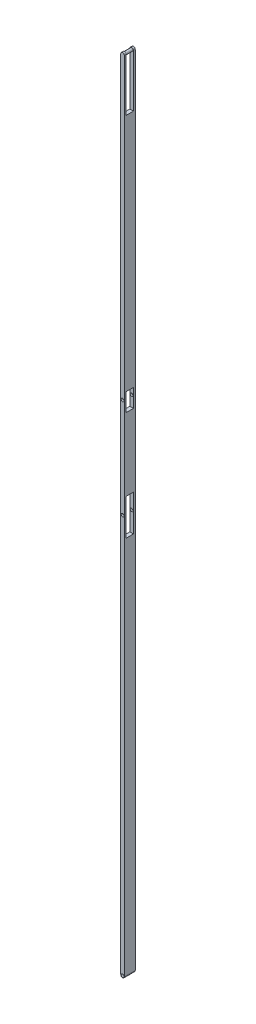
ISO-10303-21;
HEADER;
FILE_DESCRIPTION(('STEP AP214'),'2;1');
FILE_NAME('part.step','',(''),(''),'','','');
FILE_SCHEMA(('AUTOMOTIVE_DESIGN { 1 0 10303 214 1 1 1 1 }'));
ENDSEC;
DATA;
#1=APPLICATION_CONTEXT('core data for automotive mechanical design processes');
#2=APPLICATION_PROTOCOL_DEFINITION('international standard','automotive_design',2000,#1);
#3=PRODUCT_CONTEXT('',#1,'mechanical');
#4=PRODUCT('Part','Part','',(#3));
#5=PRODUCT_RELATED_PRODUCT_CATEGORY('part','',(#4));
#6=PRODUCT_DEFINITION_FORMATION('','',#4);
#7=PRODUCT_DEFINITION_CONTEXT('part definition',#1,'design');
#8=PRODUCT_DEFINITION('design','',#6,#7);
#9=PRODUCT_DEFINITION_SHAPE('','',#8);
#10=(LENGTH_UNIT() NAMED_UNIT(*) SI_UNIT(.MILLI.,.METRE.));
#11=(NAMED_UNIT(*) PLANE_ANGLE_UNIT() SI_UNIT($,.RADIAN.));
#12=(NAMED_UNIT(*) SI_UNIT($,.STERADIAN.) SOLID_ANGLE_UNIT());
#13=UNCERTAINTY_MEASURE_WITH_UNIT(LENGTH_MEASURE(1.E-05),#10,'distance_accuracy_value','');
#14=(GEOMETRIC_REPRESENTATION_CONTEXT(3) GLOBAL_UNCERTAINTY_ASSIGNED_CONTEXT((#13)) GLOBAL_UNIT_ASSIGNED_CONTEXT((#10,
#11,#12)) REPRESENTATION_CONTEXT('',''));
#15=CARTESIAN_POINT('',(0.,0.,0.));
#16=DIRECTION('',(0.,0.,1.));
#17=DIRECTION('',(1.,0.,0.));
#18=AXIS2_PLACEMENT_3D('',#15,#16,#17);
#19=CARTESIAN_POINT('',(-2.06104888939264E-13,2200.,30.));
#20=DIRECTION('',(0.,0.,-1.));
#21=DIRECTION('',(-1.,0.,0.));
#22=AXIS2_PLACEMENT_3D('',#19,#20,#21);
#23=CYLINDRICAL_SURFACE('',#22,5.00000000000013);
#24=DIRECTION('',(0.,0.,-1.));
#25=VECTOR('',#24,1.);
#26=CARTESIAN_POINT('',(4.99999999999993,2200.,30.));
#27=LINE('',#26,#25);
#28=CARTESIAN_POINT('',(4.99999999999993,2200.,30.));
#29=VERTEX_POINT('',#28);
#30=CARTESIAN_POINT('',(5.,2200.,25.));
#31=VERTEX_POINT('',#30);
#32=EDGE_CURVE('E299',#29,#31,#27,.T.);
#33=ORIENTED_EDGE('',*,*,#32,.T.);
#34=CARTESIAN_POINT('',(-2.06104888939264E-13,2200.,25.));
#35=DIRECTION('',(0.,0.,1.));
#36=DIRECTION('',(0.,-1.,0.));
#37=AXIS2_PLACEMENT_3D('',#34,#35,#36);
#38=CIRCLE('',#37,5.00000000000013);
#39=CARTESIAN_POINT('',(-5.00000000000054,2200.,25.));
#40=VERTEX_POINT('',#39);
#41=EDGE_CURVE('E185',#31,#40,#38,.T.);
#42=ORIENTED_EDGE('',*,*,#41,.T.);
#43=DIRECTION('',(0.,0.,-1.));
#44=VECTOR('',#43,1.);
#45=CARTESIAN_POINT('',(-5.00000000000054,2200.,30.));
#46=LINE('',#45,#44);
#47=CARTESIAN_POINT('',(-5.00000000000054,2200.,30.));
#48=VERTEX_POINT('',#47);
#49=EDGE_CURVE('E296',#48,#40,#46,.T.);
#50=ORIENTED_EDGE('',*,*,#49,.F.);
#51=CARTESIAN_POINT('',(-2.06104888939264E-13,2200.,30.));
#52=DIRECTION('',(0.,0.,1.));
#53=DIRECTION('',(1.,0.,0.));
#54=AXIS2_PLACEMENT_3D('',#51,#52,#53);
#55=CIRCLE('',#54,5.00000000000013);
#56=EDGE_CURVE('E280',#29,#48,#55,.T.);
#57=ORIENTED_EDGE('',*,*,#56,.F.);
#58=EDGE_LOOP('',(#33,#42,#50,#57));
#59=FACE_BOUND('',#58,.T.);
#60=ADVANCED_FACE('F41',(#59),#23,.T.);
#61=CARTESIAN_POINT('',(0.,1100.,30.));
#62=DIRECTION('',(0.,0.,-1.));
#63=DIRECTION('',(-1.,0.,0.));
#64=AXIS2_PLACEMENT_3D('',#61,#62,#63);
#65=CYLINDRICAL_SURFACE('',#64,4.);
#66=CARTESIAN_POINT('',(0.,1100.,25.));
#67=DIRECTION('',(0.,0.,1.));
#68=DIRECTION('',(0.,-1.,0.));
#69=AXIS2_PLACEMENT_3D('',#66,#67,#68);
#70=CIRCLE('',#69,4.);
#71=CARTESIAN_POINT('',(0.,1096.,25.));
#72=VERTEX_POINT('',#71);
#73=EDGE_CURVE('E231',#72,#72,#70,.F.);
#74=ORIENTED_EDGE('',*,*,#73,.T.);
#75=EDGE_LOOP('',(#74));
#76=FACE_BOUND('',#75,.T.);
#77=CARTESIAN_POINT('',(0.,1100.,30.));
#78=DIRECTION('',(0.,0.,-1.));
#79=DIRECTION('',(-1.,0.,0.));
#80=AXIS2_PLACEMENT_3D('',#77,#78,#79);
#81=CIRCLE('',#80,4.);
#82=CARTESIAN_POINT('',(-3.99999999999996,1100.,30.));
#83=VERTEX_POINT('',#82);
#84=EDGE_CURVE('E224',#83,#83,#81,.T.);
#85=ORIENTED_EDGE('',*,*,#84,.F.);
#86=EDGE_LOOP('',(#85));
#87=FACE_BOUND('',#86,.T.);
#88=ADVANCED_FACE('F311',(#76,#87),#65,.F.);
#89=CARTESIAN_POINT('',(0.,0.,30.));
#90=DIRECTION('',(0.,0.,-1.));
#91=DIRECTION('',(-1.,0.,0.));
#92=AXIS2_PLACEMENT_3D('',#89,#90,#91);
#93=CYLINDRICAL_SURFACE('',#92,5.);
#94=CARTESIAN_POINT('',(0.,0.,0.));
#95=DIRECTION('',(0.,0.,1.));
#96=DIRECTION('',(1.,0.,0.));
#97=AXIS2_PLACEMENT_3D('',#94,#95,#96);
#98=CIRCLE('',#97,5.);
#99=CARTESIAN_POINT('',(-5.,0.,0.));
#100=VERTEX_POINT('',#99);
#101=CARTESIAN_POINT('',(5.,0.,0.));
#102=VERTEX_POINT('',#101);
#103=EDGE_CURVE('E267',#100,#102,#98,.T.);
#104=ORIENTED_EDGE('',*,*,#103,.T.);
#105=DIRECTION('',(0.,0.,-1.));
#106=VECTOR('',#105,1.);
#107=CARTESIAN_POINT('',(5.,0.,30.));
#108=LINE('',#107,#106);
#109=CARTESIAN_POINT('',(5.,0.,30.));
#110=VERTEX_POINT('',#109);
#111=EDGE_CURVE('E50',#110,#102,#108,.T.);
#112=ORIENTED_EDGE('',*,*,#111,.F.);
#113=CARTESIAN_POINT('',(0.,0.,30.));
#114=DIRECTION('',(0.,0.,1.));
#115=DIRECTION('',(1.,0.,0.));
#116=AXIS2_PLACEMENT_3D('',#113,#114,#115);
#117=CIRCLE('',#116,5.);
#118=CARTESIAN_POINT('',(-5.,0.,30.));
#119=VERTEX_POINT('',#118);
#120=EDGE_CURVE('E274',#119,#110,#117,.T.);
#121=ORIENTED_EDGE('',*,*,#120,.F.);
#122=DIRECTION('',(0.,0.,-1.));
#123=VECTOR('',#122,1.);
#124=CARTESIAN_POINT('',(-5.,0.,30.));
#125=LINE('',#124,#123);
#126=EDGE_CURVE('E284',#119,#100,#125,.T.);
#127=ORIENTED_EDGE('',*,*,#126,.T.);
#128=EDGE_LOOP('',(#104,#112,#121,#127));
#129=FACE_BOUND('',#128,.T.);
#130=ADVANCED_FACE('F43',(#129),#93,.T.);
#131=CARTESIAN_POINT('',(4.99999999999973,2200.,30.));
#132=DIRECTION('',(-1.,0.,0.));
#133=DIRECTION('',(0.,-1.,0.));
#134=AXIS2_PLACEMENT_3D('',#131,#132,#133);
#135=PLANE('',#134);
#136=DIRECTION('',(0.,0.,-1.));
#137=VECTOR('',#136,1.);
#138=CARTESIAN_POINT('',(4.99999999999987,1045.,25.));
#139=LINE('',#138,#137);
#140=CARTESIAN_POINT('',(4.99999999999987,1045.,25.));
#141=VERTEX_POINT('',#140);
#142=CARTESIAN_POINT('',(4.99999999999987,1045.,4.99999999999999));
#143=VERTEX_POINT('',#142);
#144=EDGE_CURVE('E208',#141,#143,#139,.T.);
#145=ORIENTED_EDGE('',*,*,#144,.F.);
#146=DIRECTION('',(0.,-1.,0.));
#147=VECTOR('',#146,1.);
#148=CARTESIAN_POINT('',(4.99999999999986,1145.,25.));
#149=LINE('',#148,#147);
#150=CARTESIAN_POINT('',(4.99999999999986,1145.,25.));
#151=VERTEX_POINT('',#150);
#152=EDGE_CURVE('E64',#151,#141,#149,.T.);
#153=ORIENTED_EDGE('',*,*,#152,.F.);
#154=DIRECTION('',(0.,0.,1.));
#155=VECTOR('',#154,1.);
#156=CARTESIAN_POINT('',(4.99999999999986,1145.,25.));
#157=LINE('',#156,#155);
#158=CARTESIAN_POINT('',(4.99999999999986,1145.,5.));
#159=VERTEX_POINT('',#158);
#160=EDGE_CURVE('E197',#159,#151,#157,.T.);
#161=ORIENTED_EDGE('',*,*,#160,.F.);
#162=DIRECTION('',(0.,1.,0.));
#163=VECTOR('',#162,1.);
#164=CARTESIAN_POINT('',(4.99999999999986,1145.,5.));
#165=LINE('',#164,#163);
#166=EDGE_CURVE('E211',#143,#159,#165,.T.);
#167=ORIENTED_EDGE('',*,*,#166,.F.);
#168=EDGE_LOOP('',(#145,#153,#161,#167));
#169=FACE_BOUND('',#168,.T.);
#170=DIRECTION('',(0.,0.,-1.));
#171=VECTOR('',#170,1.);
#172=CARTESIAN_POINT('',(4.99999999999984,1345.,25.));
#173=LINE('',#172,#171);
#174=CARTESIAN_POINT('',(4.99999999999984,1345.,25.));
#175=VERTEX_POINT('',#174);
#176=CARTESIAN_POINT('',(4.99999999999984,1345.,4.99999999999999));
#177=VERTEX_POINT('',#176);
#178=EDGE_CURVE('E257',#175,#177,#173,.T.);
#179=ORIENTED_EDGE('',*,*,#178,.F.);
#180=DIRECTION('',(0.,-1.,0.));
#181=VECTOR('',#180,1.);
#182=CARTESIAN_POINT('',(4.99999999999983,1395.,25.));
#183=LINE('',#182,#181);
#184=CARTESIAN_POINT('',(4.99999999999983,1395.,25.));
#185=VERTEX_POINT('',#184);
#186=EDGE_CURVE('E241',#185,#175,#183,.T.);
#187=ORIENTED_EDGE('',*,*,#186,.F.);
#188=DIRECTION('',(0.,0.,1.));
#189=VECTOR('',#188,1.);
#190=CARTESIAN_POINT('',(4.99999999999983,1395.,25.));
#191=LINE('',#190,#189);
#192=CARTESIAN_POINT('',(4.99999999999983,1395.,5.));
#193=VERTEX_POINT('',#192);
#194=EDGE_CURVE('E246',#193,#185,#191,.T.);
#195=ORIENTED_EDGE('',*,*,#194,.F.);
#196=DIRECTION('',(0.,1.,0.));
#197=VECTOR('',#196,1.);
#198=CARTESIAN_POINT('',(4.99999999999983,1395.,5.));
#199=LINE('',#198,#197);
#200=EDGE_CURVE('E260',#177,#193,#199,.T.);
#201=ORIENTED_EDGE('',*,*,#200,.F.);
#202=EDGE_LOOP('',(#179,#187,#195,#201));
#203=FACE_BOUND('',#202,.T.);
#204=DIRECTION('',(0.,0.,1.));
#205=VECTOR('',#204,1.);
#206=CARTESIAN_POINT('',(5.00000000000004,2055.,25.));
#207=LINE('',#206,#205);
#208=CARTESIAN_POINT('',(5.00000000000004,2055.,5.00000000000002));
#209=VERTEX_POINT('',#208);
#210=CARTESIAN_POINT('',(5.00000000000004,2055.,25.));
#211=VERTEX_POINT('',#210);
#212=EDGE_CURVE('E162',#209,#211,#207,.T.);
#213=ORIENTED_EDGE('',*,*,#212,.T.);
#214=DIRECTION('',(0.,1.,0.));
#215=VECTOR('',#214,1.);
#216=CARTESIAN_POINT('',(5.,2205.,25.));
#217=LINE('',#216,#215);
#218=EDGE_CURVE('E173',#211,#31,#217,.T.);
#219=ORIENTED_EDGE('',*,*,#218,.T.);
#220=ORIENTED_EDGE('',*,*,#32,.F.);
#221=DIRECTION('',(0.,1.,0.));
#222=VECTOR('',#221,1.);
#223=CARTESIAN_POINT('',(4.99999999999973,2200.,30.));
#224=LINE('',#223,#222);
#225=EDGE_CURVE('E277',#110,#29,#224,.T.);
#226=ORIENTED_EDGE('',*,*,#225,.F.);
#227=ORIENTED_EDGE('',*,*,#111,.T.);
#228=DIRECTION('',(0.,1.,0.));
#229=VECTOR('',#228,1.);
#230=CARTESIAN_POINT('',(4.99999999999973,2200.,0.));
#231=LINE('',#230,#229);
#232=CARTESIAN_POINT('',(4.99999999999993,2200.,0.));
#233=VERTEX_POINT('',#232);
#234=EDGE_CURVE('E287',#102,#233,#231,.T.);
#235=ORIENTED_EDGE('',*,*,#234,.T.);
#236=CARTESIAN_POINT('',(5.,2200.,5.));
#237=VERTEX_POINT('',#236);
#238=EDGE_CURVE('E172',#237,#233,#27,.T.);
#239=ORIENTED_EDGE('',*,*,#238,.F.);
#240=DIRECTION('',(0.,-1.,0.));
#241=VECTOR('',#240,1.);
#242=CARTESIAN_POINT('',(5.,2205.,5.));
#243=LINE('',#242,#241);
#244=EDGE_CURVE('E156',#237,#209,#243,.T.);
#245=ORIENTED_EDGE('',*,*,#244,.T.);
#246=EDGE_LOOP('',(#213,#219,#220,#226,#227,#235,#239,#245));
#247=FACE_BOUND('',#246,.T.);
#248=ADVANCED_FACE('F170',(#169,#203,#247),#135,.F.);
#249=CARTESIAN_POINT('',(-2.06104888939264E-13,2200.,5.));
#250=DIRECTION('',(0.,0.,-1.));
#251=DIRECTION('',(0.,1.,0.));
#252=AXIS2_PLACEMENT_3D('',#249,#250,#251);
#253=CIRCLE('',#252,5.00000000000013);
#254=CARTESIAN_POINT('',(-5.00000000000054,2200.,5.00000000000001));
#255=VERTEX_POINT('',#254);
#256=EDGE_CURVE('E57',#255,#237,#253,.T.);
#257=ORIENTED_EDGE('',*,*,#256,.T.);
#258=ORIENTED_EDGE('',*,*,#238,.T.);
#259=CARTESIAN_POINT('',(-2.06104888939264E-13,2200.,0.));
#260=DIRECTION('',(0.,0.,1.));
#261=DIRECTION('',(1.,0.,0.));
#262=AXIS2_PLACEMENT_3D('',#259,#260,#261);
#263=CIRCLE('',#262,5.00000000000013);
#264=CARTESIAN_POINT('',(-5.00000000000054,2200.,0.));
#265=VERTEX_POINT('',#264);
#266=EDGE_CURVE('E289',#233,#265,#263,.T.);
#267=ORIENTED_EDGE('',*,*,#266,.T.);
#268=EDGE_CURVE('E295',#255,#265,#46,.T.);
#269=ORIENTED_EDGE('',*,*,#268,.F.);
#270=EDGE_LOOP('',(#257,#258,#267,#269));
#271=FACE_BOUND('',#270,.T.);
#272=ADVANCED_FACE('F333',(#271),#23,.T.);
#273=CARTESIAN_POINT('',(-5.,0.,30.));
#274=DIRECTION('',(1.,0.,0.));
#275=DIRECTION('',(0.,1.,0.));
#276=AXIS2_PLACEMENT_3D('',#273,#274,#275);
#277=PLANE('',#276);
#278=DIRECTION('',(0.,0.,1.));
#279=VECTOR('',#278,1.);
#280=CARTESIAN_POINT('',(-5.00000000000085,1145.,25.));
#281=LINE('',#280,#279);
#282=CARTESIAN_POINT('',(-5.00000000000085,1145.,5.));
#283=VERTEX_POINT('',#282);
#284=CARTESIAN_POINT('',(-5.00000000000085,1145.,25.));
#285=VERTEX_POINT('',#284);
#286=EDGE_CURVE('E203',#283,#285,#281,.T.);
#287=ORIENTED_EDGE('',*,*,#286,.T.);
#288=DIRECTION('',(0.,-1.,0.));
#289=VECTOR('',#288,1.);
#290=CARTESIAN_POINT('',(-5.00000000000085,1145.,25.));
#291=LINE('',#290,#289);
#292=CARTESIAN_POINT('',(-5.00000000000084,1045.,25.));
#293=VERTEX_POINT('',#292);
#294=EDGE_CURVE('E193',#285,#293,#291,.T.);
#295=ORIENTED_EDGE('',*,*,#294,.T.);
#296=DIRECTION('',(0.,0.,-1.));
#297=VECTOR('',#296,1.);
#298=CARTESIAN_POINT('',(-5.00000000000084,1045.,25.));
#299=LINE('',#298,#297);
#300=CARTESIAN_POINT('',(-5.00000000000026,1045.,4.99999999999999));
#301=VERTEX_POINT('',#300);
#302=EDGE_CURVE('E196',#293,#301,#299,.T.);
#303=ORIENTED_EDGE('',*,*,#302,.T.);
#304=DIRECTION('',(0.,1.,0.));
#305=VECTOR('',#304,1.);
#306=CARTESIAN_POINT('',(-5.00000000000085,1145.,5.));
#307=LINE('',#306,#305);
#308=EDGE_CURVE('E200',#301,#283,#307,.T.);
#309=ORIENTED_EDGE('',*,*,#308,.T.);
#310=EDGE_LOOP('',(#287,#295,#303,#309));
#311=FACE_BOUND('',#310,.T.);
#312=DIRECTION('',(0.,0.,1.));
#313=VECTOR('',#312,1.);
#314=CARTESIAN_POINT('',(-5.00000000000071,1395.,25.));
#315=LINE('',#314,#313);
#316=CARTESIAN_POINT('',(-5.00000000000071,1395.,5.));
#317=VERTEX_POINT('',#316);
#318=CARTESIAN_POINT('',(-5.00000000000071,1395.,25.));
#319=VERTEX_POINT('',#318);
#320=EDGE_CURVE('E252',#317,#319,#315,.T.);
#321=ORIENTED_EDGE('',*,*,#320,.T.);
#322=DIRECTION('',(0.,-1.,0.));
#323=VECTOR('',#322,1.);
#324=CARTESIAN_POINT('',(-5.00000000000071,1395.,25.));
#325=LINE('',#324,#323);
#326=CARTESIAN_POINT('',(-5.0000000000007,1345.,25.));
#327=VERTEX_POINT('',#326);
#328=EDGE_CURVE('E242',#319,#327,#325,.T.);
#329=ORIENTED_EDGE('',*,*,#328,.T.);
#330=DIRECTION('',(0.,0.,-1.));
#331=VECTOR('',#330,1.);
#332=CARTESIAN_POINT('',(-5.0000000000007,1345.,25.));
#333=LINE('',#332,#331);
#334=CARTESIAN_POINT('',(-5.00000000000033,1345.,4.99999999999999));
#335=VERTEX_POINT('',#334);
#336=EDGE_CURVE('E245',#327,#335,#333,.T.);
#337=ORIENTED_EDGE('',*,*,#336,.T.);
#338=DIRECTION('',(0.,1.,0.));
#339=VECTOR('',#338,1.);
#340=CARTESIAN_POINT('',(-5.00000000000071,1395.,5.));
#341=LINE('',#340,#339);
#342=EDGE_CURVE('E249',#335,#317,#341,.T.);
#343=ORIENTED_EDGE('',*,*,#342,.T.);
#344=EDGE_LOOP('',(#321,#329,#337,#343));
#345=FACE_BOUND('',#344,.T.);
#346=ORIENTED_EDGE('',*,*,#49,.T.);
#347=DIRECTION('',(0.,1.,0.));
#348=VECTOR('',#347,1.);
#349=CARTESIAN_POINT('',(-5.00000000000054,2205.,25.));
#350=LINE('',#349,#348);
#351=CARTESIAN_POINT('',(-5.0000000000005,2055.,25.));
#352=VERTEX_POINT('',#351);
#353=EDGE_CURVE('E179',#352,#40,#350,.T.);
#354=ORIENTED_EDGE('',*,*,#353,.F.);
#355=DIRECTION('',(0.,0.,1.));
#356=VECTOR('',#355,1.);
#357=CARTESIAN_POINT('',(-5.0000000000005,2055.,25.));
#358=LINE('',#357,#356);
#359=CARTESIAN_POINT('',(-5.0000000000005,2055.,5.00000000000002));
#360=VERTEX_POINT('',#359);
#361=EDGE_CURVE('E175',#360,#352,#358,.T.);
#362=ORIENTED_EDGE('',*,*,#361,.F.);
#363=DIRECTION('',(0.,1.,0.));
#364=VECTOR('',#363,1.);
#365=CARTESIAN_POINT('',(-5.,0.,5.00000000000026));
#366=LINE('',#365,#364);
#367=EDGE_CURVE('E11',#360,#255,#366,.T.);
#368=ORIENTED_EDGE('',*,*,#367,.T.);
#369=ORIENTED_EDGE('',*,*,#268,.T.);
#370=DIRECTION('',(0.,-1.,0.));
#371=VECTOR('',#370,1.);
#372=CARTESIAN_POINT('',(-5.,0.,0.));
#373=LINE('',#372,#371);
#374=EDGE_CURVE('E278',#265,#100,#373,.T.);
#375=ORIENTED_EDGE('',*,*,#374,.T.);
#376=ORIENTED_EDGE('',*,*,#126,.F.);
#377=DIRECTION('',(0.,-1.,0.));
#378=VECTOR('',#377,1.);
#379=CARTESIAN_POINT('',(-5.,0.,30.));
#380=LINE('',#379,#378);
#381=EDGE_CURVE('E282',#48,#119,#380,.T.);
#382=ORIENTED_EDGE('',*,*,#381,.F.);
#383=EDGE_LOOP('',(#346,#354,#362,#368,#369,#375,#376,#382));
#384=FACE_BOUND('',#383,.T.);
#385=ADVANCED_FACE('F341',(#311,#345,#384),#277,.F.);
#386=CARTESIAN_POINT('',(0.,0.,30.));
#387=DIRECTION('',(0.,0.,1.));
#388=DIRECTION('',(1.,0.,0.));
#389=AXIS2_PLACEMENT_3D('',#386,#387,#388);
#390=PLANE('',#389);
#391=CARTESIAN_POINT('',(0.,0.,30.));
#392=DIRECTION('',(0.,0.,1.));
#393=DIRECTION('',(1.,0.,0.));
#394=AXIS2_PLACEMENT_3D('',#391,#392,#393);
#395=CIRCLE('',#394,4.);
#396=CARTESIAN_POINT('',(4.,0.,30.));
#397=VERTEX_POINT('',#396);
#398=EDGE_CURVE('E187',#397,#397,#395,.T.);
#399=ORIENTED_EDGE('',*,*,#398,.F.);
#400=EDGE_LOOP('',(#399));
#401=FACE_BOUND('',#400,.T.);
#402=ORIENTED_EDGE('',*,*,#84,.T.);
#403=EDGE_LOOP('',(#402));
#404=FACE_BOUND('',#403,.T.);
#405=CARTESIAN_POINT('',(0.,1375.,30.));
#406=DIRECTION('',(0.,0.,-1.));
#407=DIRECTION('',(-1.,0.,0.));
#408=AXIS2_PLACEMENT_3D('',#405,#406,#407);
#409=CIRCLE('',#408,4.);
#410=CARTESIAN_POINT('',(-4.,1375.,30.));
#411=VERTEX_POINT('',#410);
#412=EDGE_CURVE('E232',#411,#411,#409,.T.);
#413=ORIENTED_EDGE('',*,*,#412,.T.);
#414=EDGE_LOOP('',(#413));
#415=FACE_BOUND('',#414,.T.);
#416=ORIENTED_EDGE('',*,*,#120,.T.);
#417=ORIENTED_EDGE('',*,*,#225,.T.);
#418=ORIENTED_EDGE('',*,*,#56,.T.);
#419=ORIENTED_EDGE('',*,*,#381,.T.);
#420=EDGE_LOOP('',(#416,#417,#418,#419));
#421=FACE_BOUND('',#420,.T.);
#422=ADVANCED_FACE('F346',(#401,#404,#415,#421),#390,.T.);
#423=CARTESIAN_POINT('',(0.,0.,0.));
#424=DIRECTION('',(0.,0.,1.));
#425=DIRECTION('',(1.,0.,0.));
#426=AXIS2_PLACEMENT_3D('',#423,#424,#425);
#427=PLANE('',#426);
#428=CARTESIAN_POINT('',(0.,0.,0.));
#429=DIRECTION('',(0.,0.,1.));
#430=DIRECTION('',(1.,0.,0.));
#431=AXIS2_PLACEMENT_3D('',#428,#429,#430);
#432=CIRCLE('',#431,4.);
#433=CARTESIAN_POINT('',(4.,0.,0.));
#434=VERTEX_POINT('',#433);
#435=EDGE_CURVE('E188',#434,#434,#432,.T.);
#436=ORIENTED_EDGE('',*,*,#435,.T.);
#437=EDGE_LOOP('',(#436));
#438=FACE_BOUND('',#437,.T.);
#439=CARTESIAN_POINT('',(0.,1100.,0.));
#440=DIRECTION('',(0.,0.,-1.));
#441=DIRECTION('',(-1.,0.,0.));
#442=AXIS2_PLACEMENT_3D('',#439,#440,#441);
#443=CIRCLE('',#442,4.);
#444=CARTESIAN_POINT('',(-3.99999999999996,1100.,0.));
#445=VERTEX_POINT('',#444);
#446=EDGE_CURVE('E228',#445,#445,#443,.T.);
#447=ORIENTED_EDGE('',*,*,#446,.F.);
#448=EDGE_LOOP('',(#447));
#449=FACE_BOUND('',#448,.T.);
#450=CARTESIAN_POINT('',(0.,1375.,0.));
#451=DIRECTION('',(0.,0.,-1.));
#452=DIRECTION('',(-1.,0.,0.));
#453=AXIS2_PLACEMENT_3D('',#450,#451,#452);
#454=CIRCLE('',#453,4.);
#455=CARTESIAN_POINT('',(-4.,1375.,0.));
#456=VERTEX_POINT('',#455);
#457=EDGE_CURVE('E227',#456,#456,#454,.T.);
#458=ORIENTED_EDGE('',*,*,#457,.F.);
#459=EDGE_LOOP('',(#458));
#460=FACE_BOUND('',#459,.T.);
#461=ORIENTED_EDGE('',*,*,#103,.F.);
#462=ORIENTED_EDGE('',*,*,#374,.F.);
#463=ORIENTED_EDGE('',*,*,#266,.F.);
#464=ORIENTED_EDGE('',*,*,#234,.F.);
#465=EDGE_LOOP('',(#461,#462,#463,#464));
#466=FACE_BOUND('',#465,.T.);
#467=ADVANCED_FACE('F367',(#438,#449,#460,#466),#427,.F.);
#468=CARTESIAN_POINT('',(-5.00000000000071,1395.,25.));
#469=DIRECTION('',(0.,0.,1.));
#470=DIRECTION('',(0.,-1.,0.));
#471=AXIS2_PLACEMENT_3D('',#468,#469,#470);
#472=PLANE('',#471);
#473=CARTESIAN_POINT('',(0.,1375.,25.));
#474=DIRECTION('',(0.,0.,1.));
#475=DIRECTION('',(0.,-1.,0.));
#476=AXIS2_PLACEMENT_3D('',#473,#474,#475);
#477=CIRCLE('',#476,4.);
#478=CARTESIAN_POINT('',(0.,1371.,25.));
#479=VERTEX_POINT('',#478);
#480=EDGE_CURVE('E238',#479,#479,#477,.T.);
#481=ORIENTED_EDGE('',*,*,#480,.T.);
#482=EDGE_LOOP('',(#481));
#483=FACE_BOUND('',#482,.T.);
#484=ORIENTED_EDGE('',*,*,#186,.T.);
#485=DIRECTION('',(1.,0.,0.));
#486=VECTOR('',#485,1.);
#487=CARTESIAN_POINT('',(-5.0000000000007,1345.,25.));
#488=LINE('',#487,#486);
#489=EDGE_CURVE('E255',#327,#175,#488,.T.);
#490=ORIENTED_EDGE('',*,*,#489,.F.);
#491=ORIENTED_EDGE('',*,*,#328,.F.);
#492=DIRECTION('',(1.,0.,0.));
#493=VECTOR('',#492,1.);
#494=CARTESIAN_POINT('',(-5.00000000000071,1395.,25.));
#495=LINE('',#494,#493);
#496=EDGE_CURVE('E265',#319,#185,#495,.T.);
#497=ORIENTED_EDGE('',*,*,#496,.T.);
#498=EDGE_LOOP('',(#484,#490,#491,#497));
#499=FACE_BOUND('',#498,.T.);
#500=ADVANCED_FACE('F369',(#483,#499),#472,.F.);
#501=CARTESIAN_POINT('',(-5.00000000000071,1395.,25.));
#502=DIRECTION('',(0.,1.,0.));
#503=DIRECTION('',(-1.,0.,0.));
#504=AXIS2_PLACEMENT_3D('',#501,#502,#503);
#505=PLANE('',#504);
#506=ORIENTED_EDGE('',*,*,#194,.T.);
#507=ORIENTED_EDGE('',*,*,#496,.F.);
#508=ORIENTED_EDGE('',*,*,#320,.F.);
#509=DIRECTION('',(1.,0.,0.));
#510=VECTOR('',#509,1.);
#511=CARTESIAN_POINT('',(-5.00000000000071,1395.,5.));
#512=LINE('',#511,#510);
#513=EDGE_CURVE('E268',#317,#193,#512,.T.);
#514=ORIENTED_EDGE('',*,*,#513,.T.);
#515=EDGE_LOOP('',(#506,#507,#508,#514));
#516=FACE_BOUND('',#515,.T.);
#517=ADVANCED_FACE('F377',(#516),#505,.F.);
#518=CARTESIAN_POINT('',(-5.00000000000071,1395.,5.));
#519=DIRECTION('',(0.,0.,-1.));
#520=DIRECTION('',(0.,1.,0.));
#521=AXIS2_PLACEMENT_3D('',#518,#519,#520);
#522=PLANE('',#521);
#523=CARTESIAN_POINT('',(0.,1375.,4.99999999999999));
#524=DIRECTION('',(0.,0.,-1.));
#525=DIRECTION('',(0.,1.,0.));
#526=AXIS2_PLACEMENT_3D('',#523,#524,#525);
#527=CIRCLE('',#526,4.);
#528=CARTESIAN_POINT('',(0.,1379.,4.99999999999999));
#529=VERTEX_POINT('',#528);
#530=EDGE_CURVE('E235',#529,#529,#527,.T.);
#531=ORIENTED_EDGE('',*,*,#530,.T.);
#532=EDGE_LOOP('',(#531));
#533=FACE_BOUND('',#532,.T.);
#534=ORIENTED_EDGE('',*,*,#200,.T.);
#535=ORIENTED_EDGE('',*,*,#513,.F.);
#536=ORIENTED_EDGE('',*,*,#342,.F.);
#537=DIRECTION('',(1.,0.,0.));
#538=VECTOR('',#537,1.);
#539=CARTESIAN_POINT('',(-5.0000000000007,1345.,4.99999999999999));
#540=LINE('',#539,#538);
#541=EDGE_CURVE('E270',#335,#177,#540,.T.);
#542=ORIENTED_EDGE('',*,*,#541,.T.);
#543=EDGE_LOOP('',(#534,#535,#536,#542));
#544=FACE_BOUND('',#543,.T.);
#545=ADVANCED_FACE('F389',(#533,#544),#522,.F.);
#546=CARTESIAN_POINT('',(-5.0000000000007,1345.,25.));
#547=DIRECTION('',(0.,-1.,0.));
#548=DIRECTION('',(1.,0.,0.));
#549=AXIS2_PLACEMENT_3D('',#546,#547,#548);
#550=PLANE('',#549);
#551=ORIENTED_EDGE('',*,*,#178,.T.);
#552=ORIENTED_EDGE('',*,*,#541,.F.);
#553=ORIENTED_EDGE('',*,*,#336,.F.);
#554=ORIENTED_EDGE('',*,*,#489,.T.);
#555=EDGE_LOOP('',(#551,#552,#553,#554));
#556=FACE_BOUND('',#555,.T.);
#557=ADVANCED_FACE('F385',(#556),#550,.F.);
#558=CARTESIAN_POINT('',(0.,1375.,30.));
#559=DIRECTION('',(0.,0.,-1.));
#560=DIRECTION('',(-1.,0.,0.));
#561=AXIS2_PLACEMENT_3D('',#558,#559,#560);
#562=CYLINDRICAL_SURFACE('',#561,4.);
#563=ORIENTED_EDGE('',*,*,#457,.T.);
#564=EDGE_LOOP('',(#563));
#565=FACE_BOUND('',#564,.T.);
#566=ORIENTED_EDGE('',*,*,#530,.F.);
#567=EDGE_LOOP('',(#566));
#568=FACE_BOUND('',#567,.T.);
#569=ADVANCED_FACE('F388',(#565,#568),#562,.F.);
#570=ORIENTED_EDGE('',*,*,#412,.F.);
#571=EDGE_LOOP('',(#570));
#572=FACE_BOUND('',#571,.T.);
#573=ORIENTED_EDGE('',*,*,#480,.F.);
#574=EDGE_LOOP('',(#573));
#575=FACE_BOUND('',#574,.T.);
#576=ADVANCED_FACE('F326',(#572,#575),#562,.F.);
#577=CARTESIAN_POINT('',(0.,1100.,4.99999999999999));
#578=DIRECTION('',(0.,0.,-1.));
#579=DIRECTION('',(0.,1.,0.));
#580=AXIS2_PLACEMENT_3D('',#577,#578,#579);
#581=CIRCLE('',#580,4.);
#582=CARTESIAN_POINT('',(0.,1104.,4.99999999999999));
#583=VERTEX_POINT('',#582);
#584=EDGE_CURVE('E218',#583,#583,#581,.F.);
#585=ORIENTED_EDGE('',*,*,#584,.T.);
#586=EDGE_LOOP('',(#585));
#587=FACE_BOUND('',#586,.T.);
#588=ORIENTED_EDGE('',*,*,#446,.T.);
#589=EDGE_LOOP('',(#588));
#590=FACE_BOUND('',#589,.T.);
#591=ADVANCED_FACE('F317',(#587,#590),#65,.F.);
#592=CARTESIAN_POINT('',(-5.00000000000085,1145.,25.));
#593=DIRECTION('',(0.,0.,1.));
#594=DIRECTION('',(0.,-1.,0.));
#595=AXIS2_PLACEMENT_3D('',#592,#593,#594);
#596=PLANE('',#595);
#597=ORIENTED_EDGE('',*,*,#152,.T.);
#598=DIRECTION('',(1.,0.,0.));
#599=VECTOR('',#598,1.);
#600=CARTESIAN_POINT('',(-5.00000000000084,1045.,25.));
#601=LINE('',#600,#599);
#602=EDGE_CURVE('E206',#293,#141,#601,.T.);
#603=ORIENTED_EDGE('',*,*,#602,.F.);
#604=ORIENTED_EDGE('',*,*,#294,.F.);
#605=DIRECTION('',(1.,0.,0.));
#606=VECTOR('',#605,1.);
#607=CARTESIAN_POINT('',(-5.00000000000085,1145.,25.));
#608=LINE('',#607,#606);
#609=EDGE_CURVE('E216',#285,#151,#608,.T.);
#610=ORIENTED_EDGE('',*,*,#609,.T.);
#611=EDGE_LOOP('',(#597,#603,#604,#610));
#612=FACE_BOUND('',#611,.T.);
#613=ORIENTED_EDGE('',*,*,#73,.F.);
#614=EDGE_LOOP('',(#613));
#615=FACE_BOUND('',#614,.T.);
#616=ADVANCED_FACE('F314',(#612,#615),#596,.F.);
#617=CARTESIAN_POINT('',(-5.00000000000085,1145.,5.));
#618=DIRECTION('',(0.,0.,-1.));
#619=DIRECTION('',(0.,1.,0.));
#620=AXIS2_PLACEMENT_3D('',#617,#618,#619);
#621=PLANE('',#620);
#622=ORIENTED_EDGE('',*,*,#166,.T.);
#623=DIRECTION('',(1.,0.,0.));
#624=VECTOR('',#623,1.);
#625=CARTESIAN_POINT('',(-5.00000000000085,1145.,5.));
#626=LINE('',#625,#624);
#627=EDGE_CURVE('E219',#283,#159,#626,.T.);
#628=ORIENTED_EDGE('',*,*,#627,.F.);
#629=ORIENTED_EDGE('',*,*,#308,.F.);
#630=DIRECTION('',(1.,0.,0.));
#631=VECTOR('',#630,1.);
#632=CARTESIAN_POINT('',(-5.00000000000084,1045.,4.99999999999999));
#633=LINE('',#632,#631);
#634=EDGE_CURVE('E221',#301,#143,#633,.T.);
#635=ORIENTED_EDGE('',*,*,#634,.T.);
#636=EDGE_LOOP('',(#622,#628,#629,#635));
#637=FACE_BOUND('',#636,.T.);
#638=ORIENTED_EDGE('',*,*,#584,.F.);
#639=EDGE_LOOP('',(#638));
#640=FACE_BOUND('',#639,.T.);
#641=ADVANCED_FACE('F316',(#637,#640),#621,.F.);
#642=CARTESIAN_POINT('',(-5.00000000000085,1145.,25.));
#643=DIRECTION('',(0.,1.,0.));
#644=DIRECTION('',(-1.,0.,0.));
#645=AXIS2_PLACEMENT_3D('',#642,#643,#644);
#646=PLANE('',#645);
#647=ORIENTED_EDGE('',*,*,#160,.T.);
#648=ORIENTED_EDGE('',*,*,#609,.F.);
#649=ORIENTED_EDGE('',*,*,#286,.F.);
#650=ORIENTED_EDGE('',*,*,#627,.T.);
#651=EDGE_LOOP('',(#647,#648,#649,#650));
#652=FACE_BOUND('',#651,.T.);
#653=ADVANCED_FACE('F323',(#652),#646,.F.);
#654=CARTESIAN_POINT('',(-5.00000000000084,1045.,25.));
#655=DIRECTION('',(0.,-1.,0.));
#656=DIRECTION('',(1.,0.,0.));
#657=AXIS2_PLACEMENT_3D('',#654,#655,#656);
#658=PLANE('',#657);
#659=ORIENTED_EDGE('',*,*,#144,.T.);
#660=ORIENTED_EDGE('',*,*,#634,.F.);
#661=ORIENTED_EDGE('',*,*,#302,.F.);
#662=ORIENTED_EDGE('',*,*,#602,.T.);
#663=EDGE_LOOP('',(#659,#660,#661,#662));
#664=FACE_BOUND('',#663,.T.);
#665=ADVANCED_FACE('F516',(#664),#658,.F.);
#666=CARTESIAN_POINT('',(0.,0.,0.));
#667=DIRECTION('',(0.,0.,1.));
#668=DIRECTION('',(1.,0.,0.));
#669=AXIS2_PLACEMENT_3D('',#666,#667,#668);
#670=CYLINDRICAL_SURFACE('',#669,4.);
#671=ORIENTED_EDGE('',*,*,#435,.F.);
#672=EDGE_LOOP('',(#671));
#673=FACE_BOUND('',#672,.T.);
#674=ORIENTED_EDGE('',*,*,#398,.T.);
#675=EDGE_LOOP('',(#674));
#676=FACE_BOUND('',#675,.T.);
#677=ADVANCED_FACE('F524',(#673,#676),#670,.F.);
#678=CARTESIAN_POINT('',(5.,2205.,25.));
#679=DIRECTION('',(0.,0.,1.));
#680=DIRECTION('',(0.,-1.,0.));
#681=AXIS2_PLACEMENT_3D('',#678,#679,#680);
#682=PLANE('',#681);
#683=CARTESIAN_POINT('',(-2.06104888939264E-13,2200.,25.));
#684=DIRECTION('',(0.,0.,1.));
#685=DIRECTION('',(0.,-1.,0.));
#686=AXIS2_PLACEMENT_3D('',#683,#684,#685);
#687=CIRCLE('',#686,4.);
#688=CARTESIAN_POINT('',(-2.06104888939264E-13,2196.,25.));
#689=VERTEX_POINT('',#688);
#690=EDGE_CURVE('E574',#689,#689,#687,.F.);
#691=ORIENTED_EDGE('',*,*,#690,.F.);
#692=EDGE_LOOP('',(#691));
#693=FACE_BOUND('',#692,.T.);
#694=ORIENTED_EDGE('',*,*,#218,.F.);
#695=DIRECTION('',(-1.,0.,0.));
#696=VECTOR('',#695,1.);
#697=CARTESIAN_POINT('',(5.00000000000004,2055.,25.));
#698=LINE('',#697,#696);
#699=EDGE_CURVE('E161',#211,#352,#698,.T.);
#700=ORIENTED_EDGE('',*,*,#699,.T.);
#701=ORIENTED_EDGE('',*,*,#353,.T.);
#702=ORIENTED_EDGE('',*,*,#41,.F.);
#703=EDGE_LOOP('',(#694,#700,#701,#702));
#704=FACE_BOUND('',#703,.T.);
#705=ADVANCED_FACE('F358',(#693,#704),#682,.F.);
#706=CARTESIAN_POINT('',(5.,2205.,5.));
#707=DIRECTION('',(0.,0.,-1.));
#708=DIRECTION('',(0.,1.,0.));
#709=AXIS2_PLACEMENT_3D('',#706,#707,#708);
#710=PLANE('',#709);
#711=CARTESIAN_POINT('',(-2.06104888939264E-13,2200.,5.));
#712=DIRECTION('',(0.,0.,-1.));
#713=DIRECTION('',(0.,1.,0.));
#714=AXIS2_PLACEMENT_3D('',#711,#712,#713);
#715=CIRCLE('',#714,4.);
#716=CARTESIAN_POINT('',(-2.06104888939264E-13,2204.,5.));
#717=VERTEX_POINT('',#716);
#718=EDGE_CURVE('E45',#717,#717,#715,.T.);
#719=ORIENTED_EDGE('',*,*,#718,.T.);
#720=EDGE_LOOP('',(#719));
#721=FACE_BOUND('',#720,.T.);
#722=ORIENTED_EDGE('',*,*,#256,.F.);
#723=ORIENTED_EDGE('',*,*,#367,.F.);
#724=DIRECTION('',(-1.,0.,0.));
#725=VECTOR('',#724,1.);
#726=CARTESIAN_POINT('',(5.00000000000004,2055.,5.00000000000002));
#727=LINE('',#726,#725);
#728=EDGE_CURVE('E152',#209,#360,#727,.T.);
#729=ORIENTED_EDGE('',*,*,#728,.F.);
#730=ORIENTED_EDGE('',*,*,#244,.F.);
#731=EDGE_LOOP('',(#722,#723,#729,#730));
#732=FACE_BOUND('',#731,.T.);
#733=ADVANCED_FACE('F154',(#721,#732),#710,.F.);
#734=CARTESIAN_POINT('',(5.00000000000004,2055.,25.));
#735=DIRECTION('',(0.,-1.,0.));
#736=DIRECTION('',(1.,0.,0.));
#737=AXIS2_PLACEMENT_3D('',#734,#735,#736);
#738=PLANE('',#737);
#739=ORIENTED_EDGE('',*,*,#361,.T.);
#740=ORIENTED_EDGE('',*,*,#699,.F.);
#741=ORIENTED_EDGE('',*,*,#212,.F.);
#742=ORIENTED_EDGE('',*,*,#728,.T.);
#743=EDGE_LOOP('',(#739,#740,#741,#742));
#744=FACE_BOUND('',#743,.T.);
#745=ADVANCED_FACE('F165',(#744),#738,.F.);
#746=CARTESIAN_POINT('',(-2.06104888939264E-13,2200.,36.3137084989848));
#747=DIRECTION('',(0.,0.,-1.));
#748=DIRECTION('',(-1.,0.,0.));
#749=AXIS2_PLACEMENT_3D('',#746,#747,#748);
#750=CYLINDRICAL_SURFACE('',#749,4.);
#751=ORIENTED_EDGE('',*,*,#690,.T.);
#752=EDGE_LOOP('',(#751));
#753=FACE_BOUND('',#752,.T.);
#754=ORIENTED_EDGE('',*,*,#718,.F.);
#755=EDGE_LOOP('',(#754));
#756=FACE_BOUND('',#755,.T.);
#757=ADVANCED_FACE('F557',(#753,#756),#750,.T.);
#758=CLOSED_SHELL('',(#60,#88,#130,#248,#272,#385,#422,#467,#500,#517,#545,#557,#569,#576,#591,
#616,#641,#653,#665,#677,#705,#733,#745,#757));
#759=MANIFOLD_SOLID_BREP('B2',#758);
#760=ADVANCED_BREP_SHAPE_REPRESENTATION('',(#18,#759),#14);
#761=SHAPE_DEFINITION_REPRESENTATION(#9,#760);
ENDSEC;
END-ISO-10303-21;
